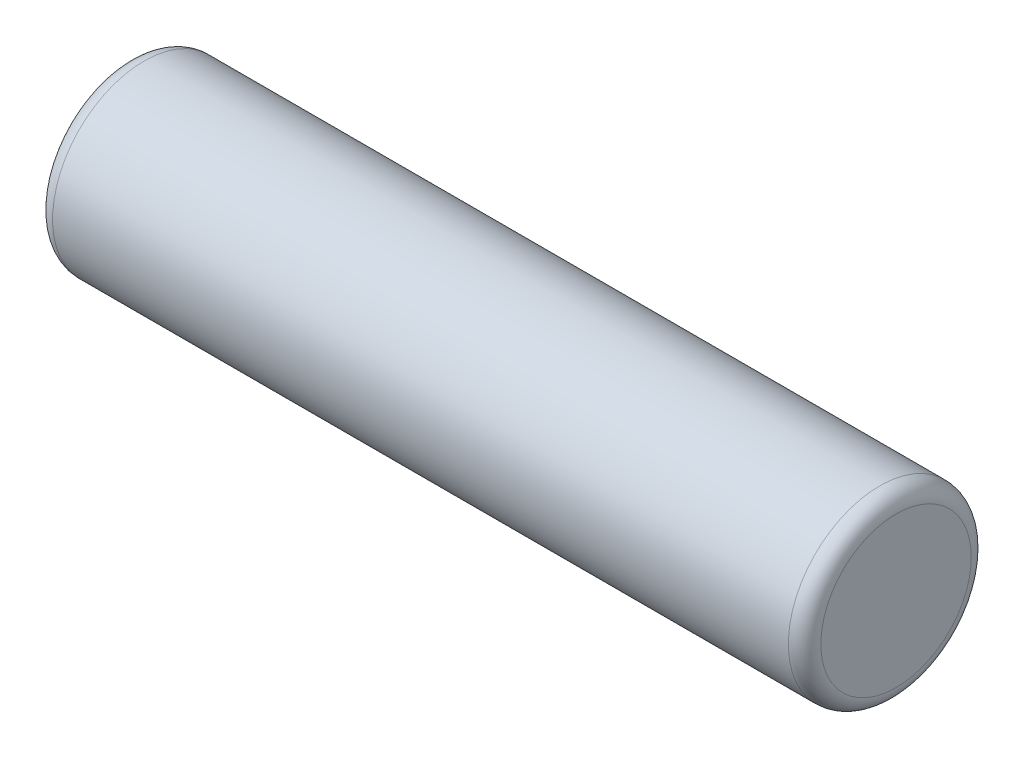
from build123d import *


with BuildPart() as part:
    # Esquisse1 → R_volution1 (revolve)
    with BuildSketch(Plane.XY, mode=Mode.PRIVATE) as r_volution1_sk:
        with BuildLine():
            Line((1.85, 7.366666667), (1.85, 6.75))
            Line((1.85, 6.75), (8.15, 6.75))
            Line((8.15, 6.75), (8.15, 7.366666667))
            ThreePointArc((8.15, 7.366666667), (8.110947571, 7.460947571), (8.016666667, 7.5))
            Line((8.016666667, 7.5), (1.983333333, 7.5))
            ThreePointArc((1.983333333, 7.5), (1.889052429, 7.460947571), (1.85, 7.366666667))
        make_face()
    revolve(r_volution1_sk.sketch.rotate(Axis((1.84874157, 6.75, 0), (1, 0, 0)), 270), axis=Axis((1.84874157, 6.75, 0), (1, 0, 0)))


solid = part.part
